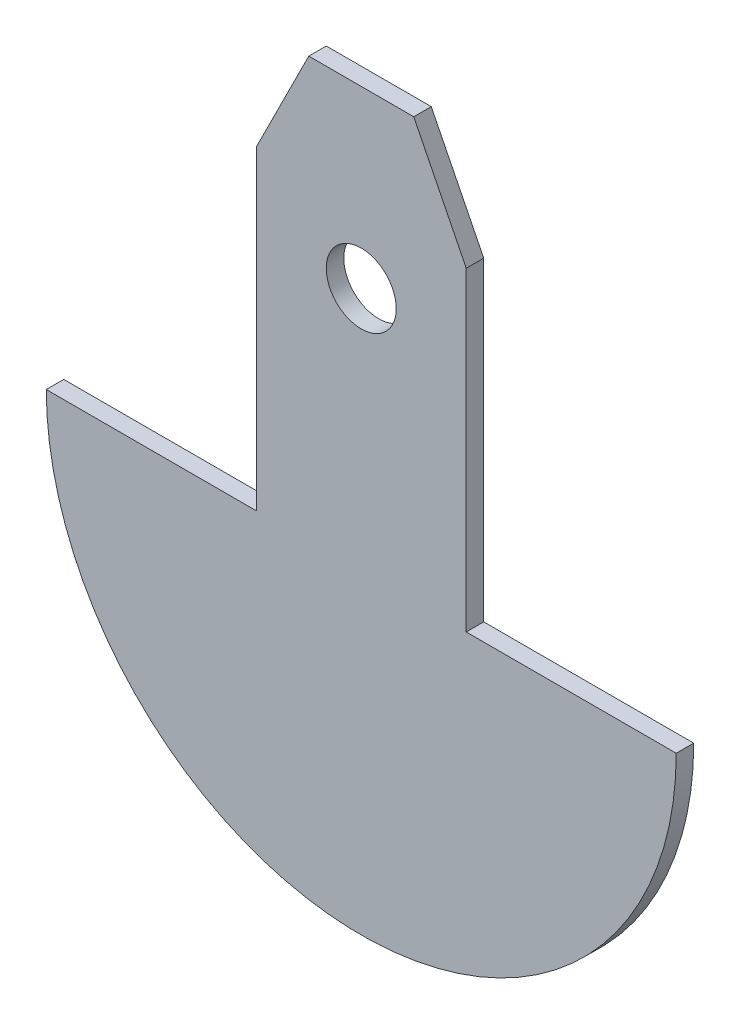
from build123d import *

# Parameters (mm, degrees)
EXTRUDE1_DEPTH = 6.35
SKETCH2_R      = 12.7
EXTRUDE2_DEPTH = 275.816379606


with BuildPart() as part:
    # Sketch1 → Extrude1 (new body)
    with BuildSketch(Plane.XY):
        with BuildLine():
            Line((76.2, 0), (0, 0))
            ThreePointArc((0, 0), (114.3, -114.3), (228.6, 0))
            Line((228.6, 0), (152.4, 0))
            Line((152.4, 0), (152.4, 114.3))
            Line((152.4, 114.3), (133.35, 152.4))
            Line((133.35, 152.4), (114.3, 152.4))
            Line((114.3, 152.4), (95.25, 152.4))
            Line((95.25, 152.4), (76.2, 114.3))
            Line((76.2, 114.3), (76.2, 0))
        make_face()
    extrude(amount=EXTRUDE1_DEPTH)

    # Sketch2 → Extrude2 (cut, through all)
    with BuildSketch(Plane.XY.offset(6.35)):
        with Locations((114.3, 88.9)):
            Circle(SKETCH2_R)
    extrude(amount=-EXTRUDE2_DEPTH, mode=Mode.SUBTRACT)


solid = part.part
